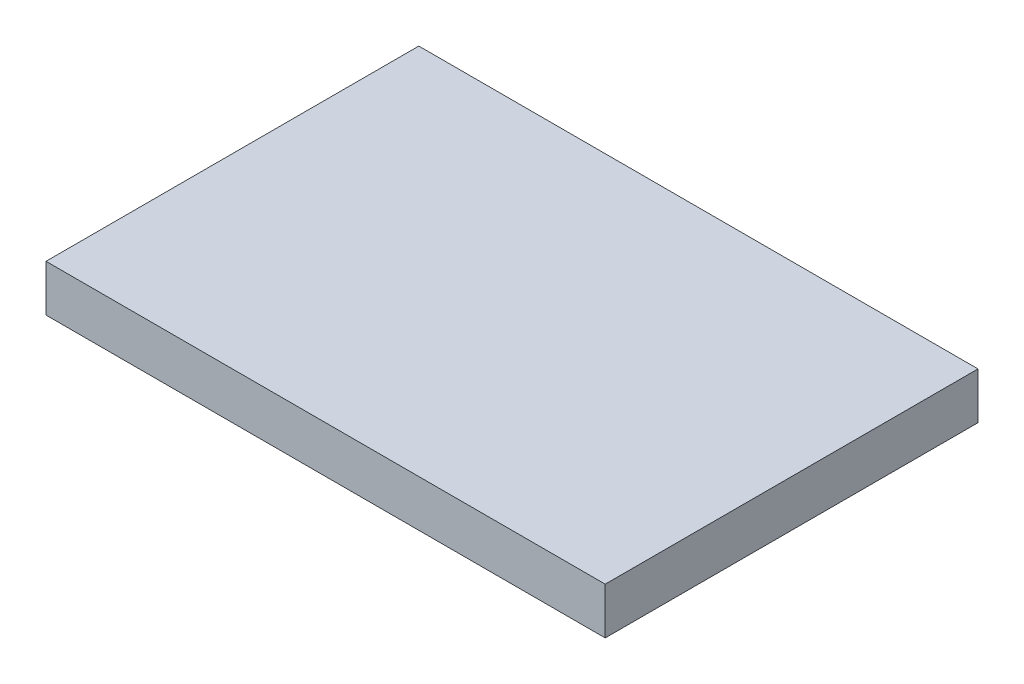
from build123d import *

# Parameters (mm, degrees)
SKETCH1_W      = 152.4
SKETCH1_H      = 12.7
EXTRUDE1_DEPTH = 101.6


with BuildPart() as part:
    # Sketch1 → Extrude1 (new body)
    with BuildSketch(Plane.XY):
        with Locations((76.2, 6.35)):
            Rectangle(SKETCH1_W, SKETCH1_H)
    extrude(amount=EXTRUDE1_DEPTH)


solid = part.part
